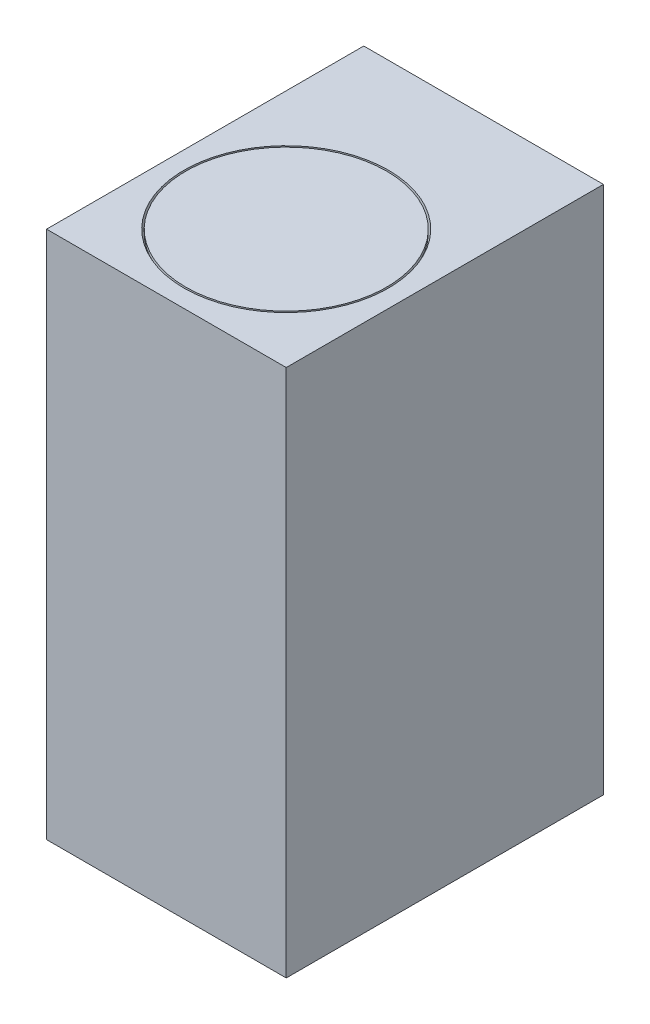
from build123d import *

# Parameters (mm, degrees)
CROQUIS1_W              = 68
CROQUIS1_H              = 150
SALIENTE_EXTRUIR1_DEPTH = 90
CROQUIS2_R              = 29
CORTAR_EXTRUIR1_DEPTH   = 90
CROQUIS3_R              = 28
SALIENTE_EXTRUIR2_DEPTH = 85
CROQUIS4_R              = 28.5
SALIENTE_EXTRUIR3_DEPTH = 1


with BuildPart() as part:
    # Croquis1 → Saliente-Extruir1 (new body)
    with BuildSketch(Plane.XY):
        with Locations((34, 75)):
            Rectangle(CROQUIS1_W, CROQUIS1_H)
    extrude(amount=SALIENTE_EXTRUIR1_DEPTH)

    # Croquis2 → Cortar-Extruir1 (cut)
    with BuildSketch(Plane(origin=(0, 150, 0), x_dir=(1, 0, 0), z_dir=(0, 1, 0))):
        with Locations(Location((34, -56, 0), (0, 0, 270))):
            Circle(CROQUIS2_R)
    extrude(amount=-CORTAR_EXTRUIR1_DEPTH, mode=Mode.SUBTRACT)

    # Croquis3 → Saliente-Extruir2 (add)
    with BuildSketch(Plane(origin=(0, 60, 0), x_dir=(1, 0, 0), z_dir=(0, 1, 0))):
        with Locations(Location((34, -56, 0), (0, 0, 270))):
            Circle(CROQUIS3_R)
    extrude(amount=SALIENTE_EXTRUIR2_DEPTH)


with BuildPart() as body_2:
    # Croquis4 → Saliente-Extruir3 (new body)
    with BuildSketch(Plane(origin=(0, 150, 0), x_dir=(1, 0, 0), z_dir=(0, 1, 0))):
        with Locations(Location((34, -56, 0), (0, 0, 270))):
            Circle(CROQUIS4_R)
    extrude(amount=-SALIENTE_EXTRUIR3_DEPTH)


solid = Compound([part.part, body_2.part])
